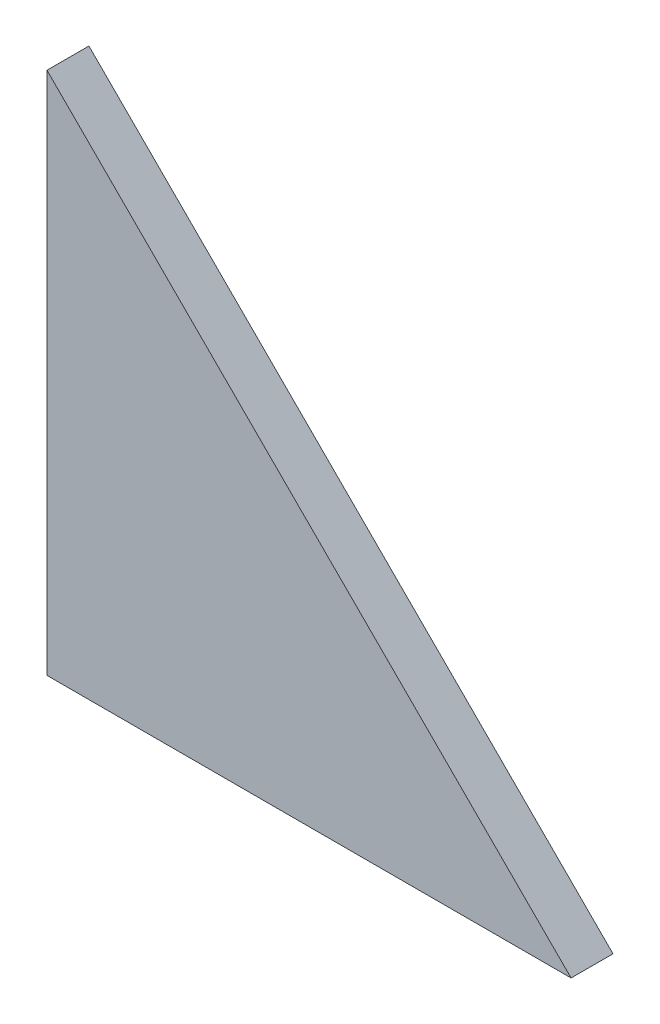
ISO-10303-21;
HEADER;
FILE_DESCRIPTION(('STEP AP214'),'2;1');
FILE_NAME('part.step','',(''),(''),'','','');
FILE_SCHEMA(('AUTOMOTIVE_DESIGN { 1 0 10303 214 1 1 1 1 }'));
ENDSEC;
DATA;
#1=APPLICATION_CONTEXT('core data for automotive mechanical design processes');
#2=APPLICATION_PROTOCOL_DEFINITION('international standard','automotive_design',2000,#1);
#3=PRODUCT_CONTEXT('',#1,'mechanical');
#4=PRODUCT('Part','Part','',(#3));
#5=PRODUCT_RELATED_PRODUCT_CATEGORY('part','',(#4));
#6=PRODUCT_DEFINITION_FORMATION('','',#4);
#7=PRODUCT_DEFINITION_CONTEXT('part definition',#1,'design');
#8=PRODUCT_DEFINITION('design','',#6,#7);
#9=PRODUCT_DEFINITION_SHAPE('','',#8);
#10=(LENGTH_UNIT() NAMED_UNIT(*) SI_UNIT(.MILLI.,.METRE.));
#11=(NAMED_UNIT(*) PLANE_ANGLE_UNIT() SI_UNIT($,.RADIAN.));
#12=(NAMED_UNIT(*) SI_UNIT($,.STERADIAN.) SOLID_ANGLE_UNIT());
#13=UNCERTAINTY_MEASURE_WITH_UNIT(LENGTH_MEASURE(1.E-05),#10,'distance_accuracy_value','');
#14=(GEOMETRIC_REPRESENTATION_CONTEXT(3) GLOBAL_UNCERTAINTY_ASSIGNED_CONTEXT((#13)) GLOBAL_UNIT_ASSIGNED_CONTEXT((#10,
#11,#12)) REPRESENTATION_CONTEXT('',''));
#15=CARTESIAN_POINT('',(0.,0.,0.));
#16=DIRECTION('',(0.,0.,1.));
#17=DIRECTION('',(1.,0.,0.));
#18=AXIS2_PLACEMENT_3D('',#15,#16,#17);
#19=CARTESIAN_POINT('',(53.033008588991,53.033008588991,12.));
#20=DIRECTION('',(0.,0.,1.));
#21=DIRECTION('',(1.,0.,0.));
#22=AXIS2_PLACEMENT_3D('',#19,#20,#21);
#23=PLANE('',#22);
#24=DIRECTION('',(1.,0.,0.));
#25=VECTOR('',#24,1.);
#26=CARTESIAN_POINT('',(0.,0.,12.));
#27=LINE('',#26,#25);
#28=CARTESIAN_POINT('',(0.,0.,12.));
#29=VERTEX_POINT('',#28);
#30=CARTESIAN_POINT('',(150.,0.,12.));
#31=VERTEX_POINT('',#30);
#32=EDGE_CURVE('E57',#29,#31,#27,.T.);
#33=ORIENTED_EDGE('',*,*,#32,.T.);
#34=DIRECTION('',(-0.707106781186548,0.707106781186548,0.));
#35=VECTOR('',#34,1.);
#36=CARTESIAN_POINT('',(150.,0.,12.));
#37=LINE('',#36,#35);
#38=CARTESIAN_POINT('',(0.,150.,12.));
#39=VERTEX_POINT('',#38);
#40=EDGE_CURVE('E59',#31,#39,#37,.T.);
#41=ORIENTED_EDGE('',*,*,#40,.T.);
#42=DIRECTION('',(0.,-1.,0.));
#43=VECTOR('',#42,1.);
#44=CARTESIAN_POINT('',(0.,150.,12.));
#45=LINE('',#44,#43);
#46=EDGE_CURVE('E10',#39,#29,#45,.T.);
#47=ORIENTED_EDGE('',*,*,#46,.T.);
#48=EDGE_LOOP('',(#33,#41,#47));
#49=FACE_BOUND('',#48,.T.);
#50=ADVANCED_FACE('F16',(#49),#23,.T.);
#51=CARTESIAN_POINT('',(53.033008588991,53.033008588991,0.));
#52=DIRECTION('',(0.,0.,1.));
#53=DIRECTION('',(1.,0.,0.));
#54=AXIS2_PLACEMENT_3D('',#51,#52,#53);
#55=PLANE('',#54);
#56=DIRECTION('',(0.,-1.,0.));
#57=VECTOR('',#56,1.);
#58=CARTESIAN_POINT('',(0.,150.,0.));
#59=LINE('',#58,#57);
#60=CARTESIAN_POINT('',(0.,150.,0.));
#61=VERTEX_POINT('',#60);
#62=CARTESIAN_POINT('',(0.,0.,0.));
#63=VERTEX_POINT('',#62);
#64=EDGE_CURVE('E26',#61,#63,#59,.T.);
#65=ORIENTED_EDGE('',*,*,#64,.F.);
#66=DIRECTION('',(-0.707106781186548,0.707106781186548,0.));
#67=VECTOR('',#66,1.);
#68=CARTESIAN_POINT('',(150.,0.,0.));
#69=LINE('',#68,#67);
#70=CARTESIAN_POINT('',(150.,0.,0.));
#71=VERTEX_POINT('',#70);
#72=EDGE_CURVE('E68',#71,#61,#69,.T.);
#73=ORIENTED_EDGE('',*,*,#72,.F.);
#74=DIRECTION('',(1.,0.,0.));
#75=VECTOR('',#74,1.);
#76=CARTESIAN_POINT('',(0.,0.,0.));
#77=LINE('',#76,#75);
#78=EDGE_CURVE('E77',#63,#71,#77,.T.);
#79=ORIENTED_EDGE('',*,*,#78,.F.);
#80=EDGE_LOOP('',(#65,#73,#79));
#81=FACE_BOUND('',#80,.T.);
#82=ADVANCED_FACE('F18',(#81),#55,.F.);
#83=CARTESIAN_POINT('',(0.,150.,0.));
#84=DIRECTION('',(1.,0.,0.));
#85=DIRECTION('',(0.,1.,0.));
#86=AXIS2_PLACEMENT_3D('',#83,#84,#85);
#87=PLANE('',#86);
#88=ORIENTED_EDGE('',*,*,#64,.T.);
#89=DIRECTION('',(0.,0.,1.));
#90=VECTOR('',#89,1.);
#91=CARTESIAN_POINT('',(0.,0.,0.));
#92=LINE('',#91,#90);
#93=EDGE_CURVE('E62',#63,#29,#92,.T.);
#94=ORIENTED_EDGE('',*,*,#93,.T.);
#95=ORIENTED_EDGE('',*,*,#46,.F.);
#96=DIRECTION('',(0.,0.,1.));
#97=VECTOR('',#96,1.);
#98=CARTESIAN_POINT('',(0.,150.,0.));
#99=LINE('',#98,#97);
#100=EDGE_CURVE('E84',#61,#39,#99,.T.);
#101=ORIENTED_EDGE('',*,*,#100,.F.);
#102=EDGE_LOOP('',(#88,#94,#95,#101));
#103=FACE_BOUND('',#102,.T.);
#104=ADVANCED_FACE('F63',(#103),#87,.F.);
#105=CARTESIAN_POINT('',(150.,0.,0.));
#106=DIRECTION('',(-0.707106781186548,-0.707106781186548,0.));
#107=DIRECTION('',(-0.707106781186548,0.707106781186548,0.));
#108=AXIS2_PLACEMENT_3D('',#105,#106,#107);
#109=PLANE('',#108);
#110=ORIENTED_EDGE('',*,*,#72,.T.);
#111=ORIENTED_EDGE('',*,*,#100,.T.);
#112=ORIENTED_EDGE('',*,*,#40,.F.);
#113=DIRECTION('',(0.,0.,1.));
#114=VECTOR('',#113,1.);
#115=CARTESIAN_POINT('',(150.,0.,0.));
#116=LINE('',#115,#114);
#117=EDGE_CURVE('E72',#71,#31,#116,.T.);
#118=ORIENTED_EDGE('',*,*,#117,.F.);
#119=EDGE_LOOP('',(#110,#111,#112,#118));
#120=FACE_BOUND('',#119,.T.);
#121=ADVANCED_FACE('F99',(#120),#109,.F.);
#122=CARTESIAN_POINT('',(0.,0.,0.));
#123=DIRECTION('',(0.,1.,0.));
#124=DIRECTION('',(1.,0.,0.));
#125=AXIS2_PLACEMENT_3D('',#122,#123,#124);
#126=PLANE('',#125);
#127=ORIENTED_EDGE('',*,*,#78,.T.);
#128=ORIENTED_EDGE('',*,*,#117,.T.);
#129=ORIENTED_EDGE('',*,*,#32,.F.);
#130=ORIENTED_EDGE('',*,*,#93,.F.);
#131=EDGE_LOOP('',(#127,#128,#129,#130));
#132=FACE_BOUND('',#131,.T.);
#133=ADVANCED_FACE('F70',(#132),#126,.F.);
#134=CLOSED_SHELL('',(#50,#82,#104,#121,#133));
#135=MANIFOLD_SOLID_BREP('B1',#134);
#136=ADVANCED_BREP_SHAPE_REPRESENTATION('',(#18,#135),#14);
#137=SHAPE_DEFINITION_REPRESENTATION(#9,#136);
ENDSEC;
END-ISO-10303-21;
